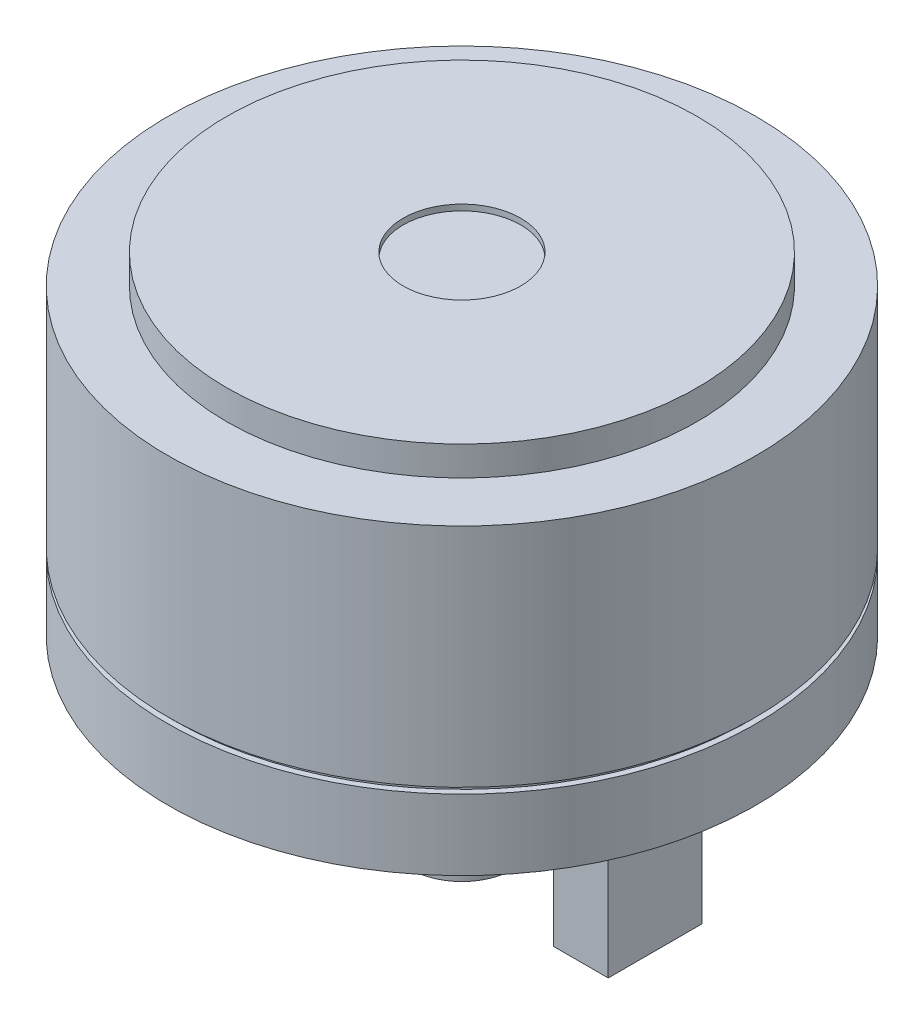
ISO-10303-21;
HEADER;
FILE_DESCRIPTION(('STEP AP214'),'2;1');
FILE_NAME('part.step','',(''),(''),'','','');
FILE_SCHEMA(('AUTOMOTIVE_DESIGN { 1 0 10303 214 1 1 1 1 }'));
ENDSEC;
DATA;
#1=APPLICATION_CONTEXT('core data for automotive mechanical design processes');
#2=APPLICATION_PROTOCOL_DEFINITION('international standard','automotive_design',2000,#1);
#3=PRODUCT_CONTEXT('',#1,'mechanical');
#4=PRODUCT('Part','Part','',(#3));
#5=PRODUCT_RELATED_PRODUCT_CATEGORY('part','',(#4));
#6=PRODUCT_DEFINITION_FORMATION('','',#4);
#7=PRODUCT_DEFINITION_CONTEXT('part definition',#1,'design');
#8=PRODUCT_DEFINITION('design','',#6,#7);
#9=PRODUCT_DEFINITION_SHAPE('','',#8);
#10=(LENGTH_UNIT() NAMED_UNIT(*) SI_UNIT(.MILLI.,.METRE.));
#11=(NAMED_UNIT(*) PLANE_ANGLE_UNIT() SI_UNIT($,.RADIAN.));
#12=(NAMED_UNIT(*) SI_UNIT($,.STERADIAN.) SOLID_ANGLE_UNIT());
#13=UNCERTAINTY_MEASURE_WITH_UNIT(LENGTH_MEASURE(1.E-05),#10,'distance_accuracy_value','');
#14=(GEOMETRIC_REPRESENTATION_CONTEXT(3) GLOBAL_UNCERTAINTY_ASSIGNED_CONTEXT((#13)) GLOBAL_UNIT_ASSIGNED_CONTEXT((#10,
#11,#12)) REPRESENTATION_CONTEXT('',''));
#15=CARTESIAN_POINT('',(0.,0.,0.));
#16=DIRECTION('',(0.,0.,1.));
#17=DIRECTION('',(1.,0.,0.));
#18=AXIS2_PLACEMENT_3D('',#15,#16,#17);
#19=CARTESIAN_POINT('',(0.,0.,-5.));
#20=DIRECTION('',(0.,-1.,0.));
#21=DIRECTION('',(0.,0.,-1.));
#22=AXIS2_PLACEMENT_3D('',#19,#20,#21);
#23=PLANE('',#22);
#24=CARTESIAN_POINT('',(0.,0.,0.));
#25=DIRECTION('',(0.,-1.,0.));
#26=DIRECTION('',(0.,0.,-1.));
#27=AXIS2_PLACEMENT_3D('',#24,#25,#26);
#28=CIRCLE('',#27,0.881235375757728);
#29=CARTESIAN_POINT('',(0.,0.,-0.881235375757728));
#30=VERTEX_POINT('',#29);
#31=EDGE_CURVE('E11',#30,#30,#28,.T.);
#32=ORIENTED_EDGE('',*,*,#31,.F.);
#33=EDGE_LOOP('',(#32));
#34=FACE_BOUND('',#33,.T.);
#35=CARTESIAN_POINT('',(0.,0.,0.));
#36=DIRECTION('',(0.,-1.,0.));
#37=DIRECTION('',(0.,0.,-1.));
#38=AXIS2_PLACEMENT_3D('',#35,#36,#37);
#39=CIRCLE('',#38,5.);
#40=CARTESIAN_POINT('',(0.,0.,-5.));
#41=VERTEX_POINT('',#40);
#42=EDGE_CURVE('E144',#41,#41,#39,.T.);
#43=ORIENTED_EDGE('',*,*,#42,.T.);
#44=EDGE_LOOP('',(#43));
#45=FACE_BOUND('',#44,.T.);
#46=DIRECTION('',(1.,0.,0.));
#47=VECTOR('',#46,1.);
#48=CARTESIAN_POINT('',(-3.28736038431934,0.,-0.798863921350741));
#49=LINE('',#48,#47);
#50=CARTESIAN_POINT('',(-3.28736038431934,0.,-0.798863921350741));
#51=VERTEX_POINT('',#50);
#52=CARTESIAN_POINT('',(-2.35302663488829,0.,-0.798863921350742));
#53=VERTEX_POINT('',#52);
#54=EDGE_CURVE('E140',#51,#53,#49,.T.);
#55=ORIENTED_EDGE('',*,*,#54,.F.);
#56=DIRECTION('',(0.,0.,-1.));
#57=VECTOR('',#56,1.);
#58=CARTESIAN_POINT('',(-3.28736038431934,0.,0.798863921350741));
#59=LINE('',#58,#57);
#60=CARTESIAN_POINT('',(-3.28736038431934,0.,0.798863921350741));
#61=VERTEX_POINT('',#60);
#62=EDGE_CURVE('E134',#61,#51,#59,.T.);
#63=ORIENTED_EDGE('',*,*,#62,.F.);
#64=DIRECTION('',(-1.,0.,0.));
#65=VECTOR('',#64,1.);
#66=CARTESIAN_POINT('',(-3.28736038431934,0.,0.798863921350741));
#67=LINE('',#66,#65);
#68=CARTESIAN_POINT('',(-2.35302663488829,0.,0.798863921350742));
#69=VERTEX_POINT('',#68);
#70=EDGE_CURVE('E119',#69,#61,#67,.T.);
#71=ORIENTED_EDGE('',*,*,#70,.F.);
#72=DIRECTION('',(0.,0.,1.));
#73=VECTOR('',#72,1.);
#74=CARTESIAN_POINT('',(-2.35302663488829,0.,0.798863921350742));
#75=LINE('',#74,#73);
#76=EDGE_CURVE('E127',#53,#69,#75,.T.);
#77=ORIENTED_EDGE('',*,*,#76,.F.);
#78=EDGE_LOOP('',(#55,#63,#71,#77));
#79=FACE_BOUND('',#78,.T.);
#80=DIRECTION('',(1.,0.,0.));
#81=VECTOR('',#80,1.);
#82=CARTESIAN_POINT('',(2.35302663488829,0.,-0.798863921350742));
#83=LINE('',#82,#81);
#84=CARTESIAN_POINT('',(2.35302663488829,0.,-0.798863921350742));
#85=VERTEX_POINT('',#84);
#86=CARTESIAN_POINT('',(3.28736038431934,0.,-0.798863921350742));
#87=VERTEX_POINT('',#86);
#88=EDGE_CURVE('E172',#85,#87,#83,.T.);
#89=ORIENTED_EDGE('',*,*,#88,.F.);
#90=DIRECTION('',(0.,0.,-1.));
#91=VECTOR('',#90,1.);
#92=CARTESIAN_POINT('',(2.35302663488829,0.,0.798863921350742));
#93=LINE('',#92,#91);
#94=CARTESIAN_POINT('',(2.35302663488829,0.,0.798863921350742));
#95=VERTEX_POINT('',#94);
#96=EDGE_CURVE('E175',#95,#85,#93,.T.);
#97=ORIENTED_EDGE('',*,*,#96,.F.);
#98=DIRECTION('',(-1.,0.,0.));
#99=VECTOR('',#98,1.);
#100=CARTESIAN_POINT('',(2.35302663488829,0.,0.798863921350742));
#101=LINE('',#100,#99);
#102=CARTESIAN_POINT('',(3.28736038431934,0.,0.798863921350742));
#103=VERTEX_POINT('',#102);
#104=EDGE_CURVE('E166',#103,#95,#101,.T.);
#105=ORIENTED_EDGE('',*,*,#104,.F.);
#106=DIRECTION('',(0.,0.,1.));
#107=VECTOR('',#106,1.);
#108=CARTESIAN_POINT('',(3.28736038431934,0.,0.798863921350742));
#109=LINE('',#108,#107);
#110=EDGE_CURVE('E168',#87,#103,#109,.T.);
#111=ORIENTED_EDGE('',*,*,#110,.F.);
#112=EDGE_LOOP('',(#89,#97,#105,#111));
#113=FACE_BOUND('',#112,.T.);
#114=ADVANCED_FACE('F51',(#34,#45,#79,#113),#23,.T.);
#115=CARTESIAN_POINT('',(0.,5.55,0.));
#116=DIRECTION('',(0.,1.,0.));
#117=DIRECTION('',(0.,0.,1.));
#118=AXIS2_PLACEMENT_3D('',#115,#116,#117);
#119=PLANE('',#118);
#120=CARTESIAN_POINT('',(0.,5.55,0.));
#121=DIRECTION('',(0.,-1.,0.));
#122=DIRECTION('',(0.,0.,-1.));
#123=AXIS2_PLACEMENT_3D('',#120,#121,#122);
#124=CIRCLE('',#123,1.);
#125=CARTESIAN_POINT('',(0.,5.55,-1.));
#126=VERTEX_POINT('',#125);
#127=EDGE_CURVE('E55',#126,#126,#124,.T.);
#128=ORIENTED_EDGE('',*,*,#127,.F.);
#129=EDGE_LOOP('',(#128));
#130=FACE_BOUND('',#129,.T.);
#131=ADVANCED_FACE('F53',(#130),#119,.T.);
#132=CARTESIAN_POINT('',(0.,0.,0.));
#133=DIRECTION('',(0.,-1.,0.));
#134=DIRECTION('',(0.,0.,-1.));
#135=AXIS2_PLACEMENT_3D('',#132,#133,#134);
#136=CYLINDRICAL_SURFACE('',#135,1.);
#137=ORIENTED_EDGE('',*,*,#127,.T.);
#138=EDGE_LOOP('',(#137));
#139=FACE_BOUND('',#138,.T.);
#140=CARTESIAN_POINT('',(0.,5.65,0.));
#141=DIRECTION('',(0.,-1.,0.));
#142=DIRECTION('',(0.,0.,-1.));
#143=AXIS2_PLACEMENT_3D('',#140,#141,#142);
#144=CIRCLE('',#143,1.);
#145=CARTESIAN_POINT('',(0.,5.65,-1.));
#146=VERTEX_POINT('',#145);
#147=EDGE_CURVE('E216',#146,#146,#144,.T.);
#148=ORIENTED_EDGE('',*,*,#147,.F.);
#149=EDGE_LOOP('',(#148));
#150=FACE_BOUND('',#149,.T.);
#151=ADVANCED_FACE('F225',(#139,#150),#136,.F.);
#152=CARTESIAN_POINT('',(0.,5.65,-1.));
#153=DIRECTION('',(0.,1.,0.));
#154=DIRECTION('',(0.,0.,1.));
#155=AXIS2_PLACEMENT_3D('',#152,#153,#154);
#156=PLANE('',#155);
#157=ORIENTED_EDGE('',*,*,#147,.T.);
#158=EDGE_LOOP('',(#157));
#159=FACE_BOUND('',#158,.T.);
#160=CARTESIAN_POINT('',(0.,5.65,0.));
#161=DIRECTION('',(0.,-1.,0.));
#162=DIRECTION('',(0.,0.,-1.));
#163=AXIS2_PLACEMENT_3D('',#160,#161,#162);
#164=CIRCLE('',#163,4.);
#165=CARTESIAN_POINT('',(0.,5.65,-4.));
#166=VERTEX_POINT('',#165);
#167=EDGE_CURVE('E213',#166,#166,#164,.T.);
#168=ORIENTED_EDGE('',*,*,#167,.F.);
#169=EDGE_LOOP('',(#168));
#170=FACE_BOUND('',#169,.T.);
#171=ADVANCED_FACE('F234',(#159,#170),#156,.T.);
#172=CARTESIAN_POINT('',(0.,0.,0.));
#173=DIRECTION('',(0.,-1.,0.));
#174=DIRECTION('',(0.,0.,-1.));
#175=AXIS2_PLACEMENT_3D('',#172,#173,#174);
#176=CYLINDRICAL_SURFACE('',#175,4.);
#177=ORIENTED_EDGE('',*,*,#167,.T.);
#178=EDGE_LOOP('',(#177));
#179=FACE_BOUND('',#178,.T.);
#180=CARTESIAN_POINT('',(0.,5.15,0.));
#181=DIRECTION('',(0.,-1.,0.));
#182=DIRECTION('',(0.,0.,-1.));
#183=AXIS2_PLACEMENT_3D('',#180,#181,#182);
#184=CIRCLE('',#183,4.);
#185=CARTESIAN_POINT('',(0.,5.15,-4.));
#186=VERTEX_POINT('',#185);
#187=EDGE_CURVE('E209',#186,#186,#184,.T.);
#188=ORIENTED_EDGE('',*,*,#187,.F.);
#189=EDGE_LOOP('',(#188));
#190=FACE_BOUND('',#189,.T.);
#191=ADVANCED_FACE('F268',(#179,#190),#176,.T.);
#192=CARTESIAN_POINT('',(0.,5.15,-4.));
#193=DIRECTION('',(0.,1.,0.));
#194=DIRECTION('',(0.,0.,1.));
#195=AXIS2_PLACEMENT_3D('',#192,#193,#194);
#196=PLANE('',#195);
#197=ORIENTED_EDGE('',*,*,#187,.T.);
#198=EDGE_LOOP('',(#197));
#199=FACE_BOUND('',#198,.T.);
#200=CARTESIAN_POINT('',(0.,5.15,0.));
#201=DIRECTION('',(0.,-1.,0.));
#202=DIRECTION('',(0.,0.,-1.));
#203=AXIS2_PLACEMENT_3D('',#200,#201,#202);
#204=CIRCLE('',#203,5.);
#205=CARTESIAN_POINT('',(0.,5.15,-5.));
#206=VERTEX_POINT('',#205);
#207=EDGE_CURVE('E205',#206,#206,#204,.T.);
#208=ORIENTED_EDGE('',*,*,#207,.F.);
#209=EDGE_LOOP('',(#208));
#210=FACE_BOUND('',#209,.T.);
#211=ADVANCED_FACE('F264',(#199,#210),#196,.T.);
#212=CARTESIAN_POINT('',(0.,0.,0.));
#213=DIRECTION('',(0.,-1.,0.));
#214=DIRECTION('',(0.,0.,-1.));
#215=AXIS2_PLACEMENT_3D('',#212,#213,#214);
#216=CYLINDRICAL_SURFACE('',#215,5.);
#217=ORIENTED_EDGE('',*,*,#207,.T.);
#218=EDGE_LOOP('',(#217));
#219=FACE_BOUND('',#218,.T.);
#220=CARTESIAN_POINT('',(0.,1.3,0.));
#221=DIRECTION('',(0.,-1.,0.));
#222=DIRECTION('',(0.,0.,-1.));
#223=AXIS2_PLACEMENT_3D('',#220,#221,#222);
#224=CIRCLE('',#223,5.);
#225=CARTESIAN_POINT('',(0.,1.3,-5.));
#226=VERTEX_POINT('',#225);
#227=EDGE_CURVE('E201',#226,#226,#224,.T.);
#228=ORIENTED_EDGE('',*,*,#227,.F.);
#229=EDGE_LOOP('',(#228));
#230=FACE_BOUND('',#229,.T.);
#231=ADVANCED_FACE('F260',(#219,#230),#216,.T.);
#232=CARTESIAN_POINT('',(0.,1.3,-5.));
#233=DIRECTION('',(0.,-1.,0.));
#234=DIRECTION('',(0.,0.,-1.));
#235=AXIS2_PLACEMENT_3D('',#232,#233,#234);
#236=PLANE('',#235);
#237=ORIENTED_EDGE('',*,*,#227,.T.);
#238=EDGE_LOOP('',(#237));
#239=FACE_BOUND('',#238,.T.);
#240=CARTESIAN_POINT('',(0.,1.3,0.));
#241=DIRECTION('',(0.,-1.,0.));
#242=DIRECTION('',(0.,0.,-1.));
#243=AXIS2_PLACEMENT_3D('',#240,#241,#242);
#244=CIRCLE('',#243,4.9);
#245=CARTESIAN_POINT('',(0.,1.3,-4.9));
#246=VERTEX_POINT('',#245);
#247=EDGE_CURVE('E197',#246,#246,#244,.T.);
#248=ORIENTED_EDGE('',*,*,#247,.F.);
#249=EDGE_LOOP('',(#248));
#250=FACE_BOUND('',#249,.T.);
#251=ADVANCED_FACE('F256',(#239,#250),#236,.T.);
#252=CARTESIAN_POINT('',(0.,0.,0.));
#253=DIRECTION('',(0.,-1.,0.));
#254=DIRECTION('',(0.,0.,-1.));
#255=AXIS2_PLACEMENT_3D('',#252,#253,#254);
#256=CYLINDRICAL_SURFACE('',#255,4.9);
#257=ORIENTED_EDGE('',*,*,#247,.T.);
#258=EDGE_LOOP('',(#257));
#259=FACE_BOUND('',#258,.T.);
#260=CARTESIAN_POINT('',(0.,1.2,0.));
#261=DIRECTION('',(0.,-1.,0.));
#262=DIRECTION('',(0.,0.,-1.));
#263=AXIS2_PLACEMENT_3D('',#260,#261,#262);
#264=CIRCLE('',#263,4.9);
#265=CARTESIAN_POINT('',(0.,1.2,-4.9));
#266=VERTEX_POINT('',#265);
#267=EDGE_CURVE('E193',#266,#266,#264,.T.);
#268=ORIENTED_EDGE('',*,*,#267,.F.);
#269=EDGE_LOOP('',(#268));
#270=FACE_BOUND('',#269,.T.);
#271=ADVANCED_FACE('F252',(#259,#270),#256,.T.);
#272=CARTESIAN_POINT('',(0.,1.2,-4.9));
#273=DIRECTION('',(0.,1.,0.));
#274=DIRECTION('',(0.,0.,1.));
#275=AXIS2_PLACEMENT_3D('',#272,#273,#274);
#276=PLANE('',#275);
#277=ORIENTED_EDGE('',*,*,#267,.T.);
#278=EDGE_LOOP('',(#277));
#279=FACE_BOUND('',#278,.T.);
#280=CARTESIAN_POINT('',(0.,1.2,0.));
#281=DIRECTION('',(0.,-1.,0.));
#282=DIRECTION('',(0.,0.,-1.));
#283=AXIS2_PLACEMENT_3D('',#280,#281,#282);
#284=CIRCLE('',#283,5.);
#285=CARTESIAN_POINT('',(0.,1.2,-5.));
#286=VERTEX_POINT('',#285);
#287=EDGE_CURVE('E189',#286,#286,#284,.T.);
#288=ORIENTED_EDGE('',*,*,#287,.F.);
#289=EDGE_LOOP('',(#288));
#290=FACE_BOUND('',#289,.T.);
#291=ADVANCED_FACE('F248',(#279,#290),#276,.T.);
#292=CARTESIAN_POINT('',(0.,0.,0.));
#293=DIRECTION('',(0.,-1.,0.));
#294=DIRECTION('',(0.,0.,-1.));
#295=AXIS2_PLACEMENT_3D('',#292,#293,#294);
#296=CYLINDRICAL_SURFACE('',#295,5.);
#297=ORIENTED_EDGE('',*,*,#287,.T.);
#298=EDGE_LOOP('',(#297));
#299=FACE_BOUND('',#298,.T.);
#300=ORIENTED_EDGE('',*,*,#42,.F.);
#301=EDGE_LOOP('',(#300));
#302=FACE_BOUND('',#301,.T.);
#303=ADVANCED_FACE('F245',(#299,#302),#296,.T.);
#304=CARTESIAN_POINT('',(-3.28736038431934,-3.,0.798863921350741));
#305=DIRECTION('',(1.,0.,0.));
#306=DIRECTION('',(0.,0.,-1.));
#307=AXIS2_PLACEMENT_3D('',#304,#305,#306);
#308=PLANE('',#307);
#309=ORIENTED_EDGE('',*,*,#62,.T.);
#310=DIRECTION('',(0.,1.,0.));
#311=VECTOR('',#310,1.);
#312=CARTESIAN_POINT('',(-3.28736038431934,-3.,-0.798863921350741));
#313=LINE('',#312,#311);
#314=CARTESIAN_POINT('',(-3.28736038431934,-3.,-0.798863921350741));
#315=VERTEX_POINT('',#314);
#316=EDGE_CURVE('E178',#315,#51,#313,.T.);
#317=ORIENTED_EDGE('',*,*,#316,.F.);
#318=DIRECTION('',(0.,0.,-1.));
#319=VECTOR('',#318,1.);
#320=CARTESIAN_POINT('',(-3.28736038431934,-3.,0.798863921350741));
#321=LINE('',#320,#319);
#322=CARTESIAN_POINT('',(-3.28736038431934,-3.,0.798863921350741));
#323=VERTEX_POINT('',#322);
#324=EDGE_CURVE('E128',#323,#315,#321,.T.);
#325=ORIENTED_EDGE('',*,*,#324,.F.);
#326=DIRECTION('',(0.,1.,0.));
#327=VECTOR('',#326,1.);
#328=CARTESIAN_POINT('',(-3.28736038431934,-3.,0.798863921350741));
#329=LINE('',#328,#327);
#330=EDGE_CURVE('E122',#323,#61,#329,.T.);
#331=ORIENTED_EDGE('',*,*,#330,.T.);
#332=EDGE_LOOP('',(#309,#317,#325,#331));
#333=FACE_BOUND('',#332,.T.);
#334=ADVANCED_FACE('F132',(#333),#308,.F.);
#335=CARTESIAN_POINT('',(-3.28736038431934,-3.,-0.798863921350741));
#336=DIRECTION('',(0.,0.,1.));
#337=DIRECTION('',(1.,0.,0.));
#338=AXIS2_PLACEMENT_3D('',#335,#336,#337);
#339=PLANE('',#338);
#340=ORIENTED_EDGE('',*,*,#54,.T.);
#341=DIRECTION('',(0.,1.,0.));
#342=VECTOR('',#341,1.);
#343=CARTESIAN_POINT('',(-2.35302663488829,-3.,-0.798863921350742));
#344=LINE('',#343,#342);
#345=CARTESIAN_POINT('',(-2.35302663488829,-3.,-0.798863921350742));
#346=VERTEX_POINT('',#345);
#347=EDGE_CURVE('E502',#346,#53,#344,.T.);
#348=ORIENTED_EDGE('',*,*,#347,.F.);
#349=DIRECTION('',(1.,0.,0.));
#350=VECTOR('',#349,1.);
#351=CARTESIAN_POINT('',(-3.28736038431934,-3.,-0.798863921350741));
#352=LINE('',#351,#350);
#353=EDGE_CURVE('E152',#315,#346,#352,.T.);
#354=ORIENTED_EDGE('',*,*,#353,.F.);
#355=ORIENTED_EDGE('',*,*,#316,.T.);
#356=EDGE_LOOP('',(#340,#348,#354,#355));
#357=FACE_BOUND('',#356,.T.);
#358=ADVANCED_FACE('F344',(#357),#339,.F.);
#359=CARTESIAN_POINT('',(-2.35302663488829,-3.,0.798863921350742));
#360=DIRECTION('',(-1.,0.,0.));
#361=DIRECTION('',(0.,0.,1.));
#362=AXIS2_PLACEMENT_3D('',#359,#360,#361);
#363=PLANE('',#362);
#364=ORIENTED_EDGE('',*,*,#76,.T.);
#365=DIRECTION('',(0.,1.,0.));
#366=VECTOR('',#365,1.);
#367=CARTESIAN_POINT('',(-2.35302663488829,-3.,0.798863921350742));
#368=LINE('',#367,#366);
#369=CARTESIAN_POINT('',(-2.35302663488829,-3.,0.798863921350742));
#370=VERTEX_POINT('',#369);
#371=EDGE_CURVE('E75',#370,#69,#368,.T.);
#372=ORIENTED_EDGE('',*,*,#371,.F.);
#373=DIRECTION('',(0.,0.,1.));
#374=VECTOR('',#373,1.);
#375=CARTESIAN_POINT('',(-2.35302663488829,-3.,0.798863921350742));
#376=LINE('',#375,#374);
#377=EDGE_CURVE('E150',#346,#370,#376,.T.);
#378=ORIENTED_EDGE('',*,*,#377,.F.);
#379=ORIENTED_EDGE('',*,*,#347,.T.);
#380=EDGE_LOOP('',(#364,#372,#378,#379));
#381=FACE_BOUND('',#380,.T.);
#382=ADVANCED_FACE('F352',(#381),#363,.F.);
#383=CARTESIAN_POINT('',(-3.28736038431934,-3.,0.798863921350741));
#384=DIRECTION('',(0.,0.,-1.));
#385=DIRECTION('',(-1.,0.,0.));
#386=AXIS2_PLACEMENT_3D('',#383,#384,#385);
#387=PLANE('',#386);
#388=ORIENTED_EDGE('',*,*,#70,.T.);
#389=ORIENTED_EDGE('',*,*,#330,.F.);
#390=DIRECTION('',(-1.,0.,0.));
#391=VECTOR('',#390,1.);
#392=CARTESIAN_POINT('',(-3.28736038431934,-3.,0.798863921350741));
#393=LINE('',#392,#391);
#394=EDGE_CURVE('E137',#370,#323,#393,.T.);
#395=ORIENTED_EDGE('',*,*,#394,.F.);
#396=ORIENTED_EDGE('',*,*,#371,.T.);
#397=EDGE_LOOP('',(#388,#389,#395,#396));
#398=FACE_BOUND('',#397,.T.);
#399=ADVANCED_FACE('F121',(#398),#387,.F.);
#400=CARTESIAN_POINT('',(0.,-3.,0.));
#401=DIRECTION('',(0.,-1.,0.));
#402=DIRECTION('',(0.,0.,-1.));
#403=AXIS2_PLACEMENT_3D('',#400,#401,#402);
#404=PLANE('',#403);
#405=ORIENTED_EDGE('',*,*,#324,.T.);
#406=ORIENTED_EDGE('',*,*,#353,.T.);
#407=ORIENTED_EDGE('',*,*,#377,.T.);
#408=ORIENTED_EDGE('',*,*,#394,.T.);
#409=EDGE_LOOP('',(#405,#406,#407,#408));
#410=FACE_BOUND('',#409,.T.);
#411=ADVANCED_FACE('F369',(#410),#404,.T.);
#412=CARTESIAN_POINT('',(2.35302663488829,-3.,0.798863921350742));
#413=DIRECTION('',(1.,0.,0.));
#414=DIRECTION('',(0.,0.,-1.));
#415=AXIS2_PLACEMENT_3D('',#412,#413,#414);
#416=PLANE('',#415);
#417=ORIENTED_EDGE('',*,*,#96,.T.);
#418=DIRECTION('',(0.,1.,0.));
#419=VECTOR('',#418,1.);
#420=CARTESIAN_POINT('',(2.35302663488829,-3.,-0.798863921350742));
#421=LINE('',#420,#419);
#422=CARTESIAN_POINT('',(2.35302663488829,-3.,-0.798863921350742));
#423=VERTEX_POINT('',#422);
#424=EDGE_CURVE('E155',#423,#85,#421,.T.);
#425=ORIENTED_EDGE('',*,*,#424,.F.);
#426=DIRECTION('',(0.,0.,-1.));
#427=VECTOR('',#426,1.);
#428=CARTESIAN_POINT('',(2.35302663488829,-3.,0.798863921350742));
#429=LINE('',#428,#427);
#430=CARTESIAN_POINT('',(2.35302663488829,-3.,0.798863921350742));
#431=VERTEX_POINT('',#430);
#432=EDGE_CURVE('E169',#431,#423,#429,.T.);
#433=ORIENTED_EDGE('',*,*,#432,.F.);
#434=DIRECTION('',(0.,1.,0.));
#435=VECTOR('',#434,1.);
#436=CARTESIAN_POINT('',(2.35302663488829,-3.,0.798863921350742));
#437=LINE('',#436,#435);
#438=EDGE_CURVE('E162',#431,#95,#437,.T.);
#439=ORIENTED_EDGE('',*,*,#438,.T.);
#440=EDGE_LOOP('',(#417,#425,#433,#439));
#441=FACE_BOUND('',#440,.T.);
#442=ADVANCED_FACE('F377',(#441),#416,.F.);
#443=CARTESIAN_POINT('',(2.35302663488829,-3.,-0.798863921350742));
#444=DIRECTION('',(0.,0.,1.));
#445=DIRECTION('',(1.,0.,0.));
#446=AXIS2_PLACEMENT_3D('',#443,#444,#445);
#447=PLANE('',#446);
#448=ORIENTED_EDGE('',*,*,#88,.T.);
#449=DIRECTION('',(0.,1.,0.));
#450=VECTOR('',#449,1.);
#451=CARTESIAN_POINT('',(3.28736038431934,-3.,-0.798863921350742));
#452=LINE('',#451,#450);
#453=CARTESIAN_POINT('',(3.28736038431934,-3.,-0.798863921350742));
#454=VERTEX_POINT('',#453);
#455=EDGE_CURVE('E157',#454,#87,#452,.T.);
#456=ORIENTED_EDGE('',*,*,#455,.F.);
#457=DIRECTION('',(1.,0.,0.));
#458=VECTOR('',#457,1.);
#459=CARTESIAN_POINT('',(2.35302663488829,-3.,-0.798863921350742));
#460=LINE('',#459,#458);
#461=EDGE_CURVE('E182',#423,#454,#460,.T.);
#462=ORIENTED_EDGE('',*,*,#461,.F.);
#463=ORIENTED_EDGE('',*,*,#424,.T.);
#464=EDGE_LOOP('',(#448,#456,#462,#463));
#465=FACE_BOUND('',#464,.T.);
#466=ADVANCED_FACE('F386',(#465),#447,.F.);
#467=CARTESIAN_POINT('',(3.28736038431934,-3.,0.798863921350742));
#468=DIRECTION('',(-1.,0.,0.));
#469=DIRECTION('',(0.,0.,1.));
#470=AXIS2_PLACEMENT_3D('',#467,#468,#469);
#471=PLANE('',#470);
#472=ORIENTED_EDGE('',*,*,#110,.T.);
#473=DIRECTION('',(0.,1.,0.));
#474=VECTOR('',#473,1.);
#475=CARTESIAN_POINT('',(3.28736038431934,-3.,0.798863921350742));
#476=LINE('',#475,#474);
#477=CARTESIAN_POINT('',(3.28736038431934,-3.,0.798863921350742));
#478=VERTEX_POINT('',#477);
#479=EDGE_CURVE('E67',#478,#103,#476,.T.);
#480=ORIENTED_EDGE('',*,*,#479,.F.);
#481=DIRECTION('',(0.,0.,1.));
#482=VECTOR('',#481,1.);
#483=CARTESIAN_POINT('',(3.28736038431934,-3.,0.798863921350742));
#484=LINE('',#483,#482);
#485=EDGE_CURVE('E180',#454,#478,#484,.T.);
#486=ORIENTED_EDGE('',*,*,#485,.F.);
#487=ORIENTED_EDGE('',*,*,#455,.T.);
#488=EDGE_LOOP('',(#472,#480,#486,#487));
#489=FACE_BOUND('',#488,.T.);
#490=ADVANCED_FACE('F395',(#489),#471,.F.);
#491=CARTESIAN_POINT('',(2.35302663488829,-3.,0.798863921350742));
#492=DIRECTION('',(0.,0.,-1.));
#493=DIRECTION('',(-1.,0.,0.));
#494=AXIS2_PLACEMENT_3D('',#491,#492,#493);
#495=PLANE('',#494);
#496=ORIENTED_EDGE('',*,*,#104,.T.);
#497=ORIENTED_EDGE('',*,*,#438,.F.);
#498=DIRECTION('',(-1.,0.,0.));
#499=VECTOR('',#498,1.);
#500=CARTESIAN_POINT('',(2.35302663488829,-3.,0.798863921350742));
#501=LINE('',#500,#499);
#502=EDGE_CURVE('E165',#478,#431,#501,.T.);
#503=ORIENTED_EDGE('',*,*,#502,.F.);
#504=ORIENTED_EDGE('',*,*,#479,.T.);
#505=EDGE_LOOP('',(#496,#497,#503,#504));
#506=FACE_BOUND('',#505,.T.);
#507=ADVANCED_FACE('F404',(#506),#495,.F.);
#508=CARTESIAN_POINT('',(0.,-3.,0.));
#509=DIRECTION('',(0.,-1.,0.));
#510=DIRECTION('',(0.,0.,-1.));
#511=AXIS2_PLACEMENT_3D('',#508,#509,#510);
#512=PLANE('',#511);
#513=ORIENTED_EDGE('',*,*,#432,.T.);
#514=ORIENTED_EDGE('',*,*,#461,.T.);
#515=ORIENTED_EDGE('',*,*,#485,.T.);
#516=ORIENTED_EDGE('',*,*,#502,.T.);
#517=EDGE_LOOP('',(#513,#514,#515,#516));
#518=FACE_BOUND('',#517,.T.);
#519=ADVANCED_FACE('F413',(#518),#512,.T.);
#520=CARTESIAN_POINT('',(0.,-3.,0.));
#521=DIRECTION('',(0.,1.,0.));
#522=DIRECTION('',(0.,0.,1.));
#523=AXIS2_PLACEMENT_3D('',#520,#521,#522);
#524=CYLINDRICAL_SURFACE('',#523,0.881235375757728);
#525=CARTESIAN_POINT('',(0.,-3.,0.));
#526=DIRECTION('',(0.,-1.,0.));
#527=DIRECTION('',(0.,0.,-1.));
#528=AXIS2_PLACEMENT_3D('',#525,#526,#527);
#529=CIRCLE('',#528,0.881235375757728);
#530=CARTESIAN_POINT('',(0.,-3.,-0.881235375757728));
#531=VERTEX_POINT('',#530);
#532=EDGE_CURVE('E141',#531,#531,#529,.T.);
#533=ORIENTED_EDGE('',*,*,#532,.F.);
#534=EDGE_LOOP('',(#533));
#535=FACE_BOUND('',#534,.T.);
#536=ORIENTED_EDGE('',*,*,#31,.T.);
#537=EDGE_LOOP('',(#536));
#538=FACE_BOUND('',#537,.T.);
#539=ADVANCED_FACE('F243',(#535,#538),#524,.T.);
#540=CARTESIAN_POINT('',(0.,-3.,0.));
#541=DIRECTION('',(0.,-1.,0.));
#542=DIRECTION('',(0.,0.,-1.));
#543=AXIS2_PLACEMENT_3D('',#540,#541,#542);
#544=PLANE('',#543);
#545=ORIENTED_EDGE('',*,*,#532,.T.);
#546=EDGE_LOOP('',(#545));
#547=FACE_BOUND('',#546,.T.);
#548=ADVANCED_FACE('F429',(#547),#544,.T.);
#549=CLOSED_SHELL('',(#114,#131,#151,#171,#191,#211,#231,#251,#271,#291,#303,#334,#358,#382,
#399,#411,#442,#466,#490,#507,#519,#539,#548));
#550=MANIFOLD_SOLID_BREP('B2',#549);
#551=ADVANCED_BREP_SHAPE_REPRESENTATION('',(#18,#550),#14);
#552=SHAPE_DEFINITION_REPRESENTATION(#9,#551);
ENDSEC;
END-ISO-10303-21;
